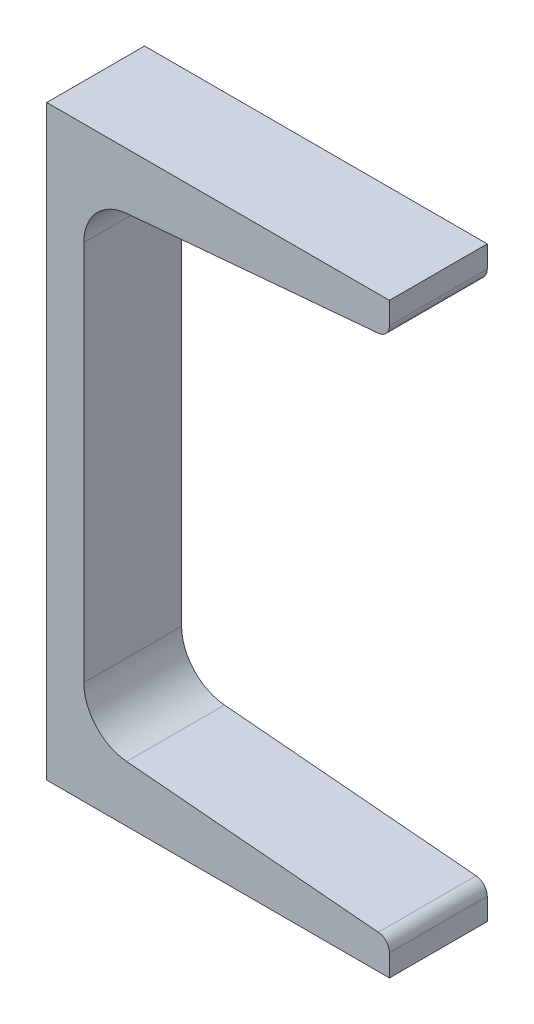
from build123d import *

# Parameters (mm, degrees)
BASEMCHANNEL_DEPTH = 12.7
TOEFILLET_R        = 3.175


with BuildPart() as part:
    # Sketch1 → BaseMchannel (new, symmetric)
    with BuildSketch(Plane.XY):
        with BuildLine():
            Line((89.0016, 152.4), (0, 152.4))
            Line((0, 152.4), (0, 0))
            Line((0, 0), (89.0016, 0))
            Line((89.0016, 0), (89.0016, 8.592793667))
            Line((89.0016, 8.592793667), (20.755997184, 14.563510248))
            ThreePointArc((20.755997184, 14.563510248), (12.82971471, 18.472320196), (9.6266, 26.709116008))
            Line((9.6266, 26.709116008), (9.6266, 125.690883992))
            ThreePointArc((9.6266, 125.690883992), (12.82971471, 133.927679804), (20.755997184, 137.836489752))
            Line((20.755997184, 137.836489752), (89.0016, 143.807206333))
            Line((89.0016, 143.807206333), (89.0016, 152.4))
        make_face()
    extrude(amount=BASEMCHANNEL_DEPTH, both=True)

    # ToeFillet
    toefillet_edges = [part.edges().sort_by_distance(p)[0] for p in [
        (89.0016, 143.807206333, 0),
        (89.0016, 8.592793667, 0),
    ]]
    fillet(toefillet_edges, radius=TOEFILLET_R)


solid = part.part
